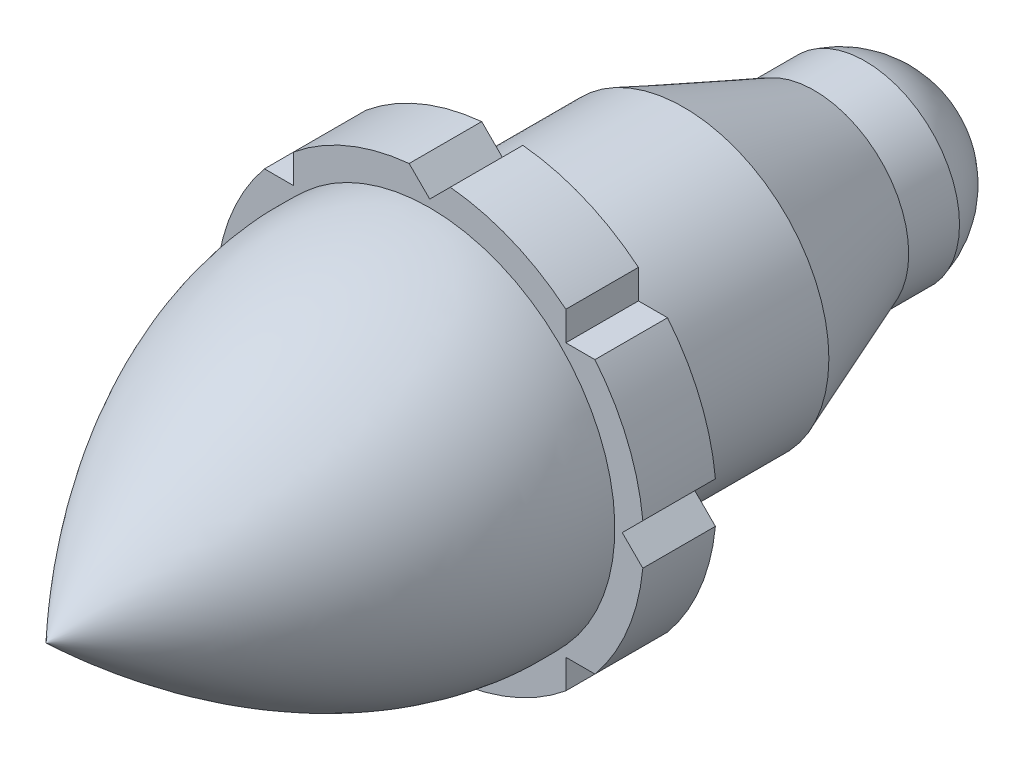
ISO-10303-21;
HEADER;
FILE_DESCRIPTION(('STEP AP214'),'2;1');
FILE_NAME('part.step','',(''),(''),'','','');
FILE_SCHEMA(('AUTOMOTIVE_DESIGN { 1 0 10303 214 1 1 1 1 }'));
ENDSEC;
DATA;
#1=APPLICATION_CONTEXT('core data for automotive mechanical design processes');
#2=APPLICATION_PROTOCOL_DEFINITION('international standard','automotive_design',2000,#1);
#3=PRODUCT_CONTEXT('',#1,'mechanical');
#4=PRODUCT('Part','Part','',(#3));
#5=PRODUCT_RELATED_PRODUCT_CATEGORY('part','',(#4));
#6=PRODUCT_DEFINITION_FORMATION('','',#4);
#7=PRODUCT_DEFINITION_CONTEXT('part definition',#1,'design');
#8=PRODUCT_DEFINITION('design','',#6,#7);
#9=PRODUCT_DEFINITION_SHAPE('','',#8);
#10=(LENGTH_UNIT() NAMED_UNIT(*) SI_UNIT(.MILLI.,.METRE.));
#11=(NAMED_UNIT(*) PLANE_ANGLE_UNIT() SI_UNIT($,.RADIAN.));
#12=(NAMED_UNIT(*) SI_UNIT($,.STERADIAN.) SOLID_ANGLE_UNIT());
#13=UNCERTAINTY_MEASURE_WITH_UNIT(LENGTH_MEASURE(1.E-05),#10,'distance_accuracy_value','');
#14=(GEOMETRIC_REPRESENTATION_CONTEXT(3) GLOBAL_UNCERTAINTY_ASSIGNED_CONTEXT((#13)) GLOBAL_UNIT_ASSIGNED_CONTEXT((#10,
#11,#12)) REPRESENTATION_CONTEXT('',''));
#15=CARTESIAN_POINT('',(0.,0.,0.));
#16=DIRECTION('',(0.,0.,1.));
#17=DIRECTION('',(1.,0.,0.));
#18=AXIS2_PLACEMENT_3D('',#15,#16,#17);
#19=CARTESIAN_POINT('',(0.,0.,5.14883468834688));
#20=DIRECTION('',(0.,0.,1.));
#21=DIRECTION('',(1.,0.,0.));
#22=AXIS2_PLACEMENT_3D('',#19,#20,#21);
#23=CYLINDRICAL_SURFACE('',#22,7.493);
#24=CARTESIAN_POINT('',(0.,0.,0.));
#25=DIRECTION('',(0.,0.,1.));
#26=DIRECTION('',(1.,0.,0.));
#27=AXIS2_PLACEMENT_3D('',#24,#25,#26);
#28=CIRCLE('',#27,7.493);
#29=CARTESIAN_POINT('',(-5.78280630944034,4.76489246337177,0.));
#30=VERTEX_POINT('',#29);
#31=CARTESIAN_POINT('',(-7.45834932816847,0.719773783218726,0.));
#32=VERTEX_POINT('',#31);
#33=EDGE_CURVE('E348',#30,#32,#28,.T.);
#34=ORIENTED_EDGE('',*,*,#33,.T.);
#35=DIRECTION('',(0.,0.,1.));
#36=VECTOR('',#35,1.);
#37=CARTESIAN_POINT('',(-7.45834932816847,0.719773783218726,-15.24));
#38=LINE('',#37,#36);
#39=CARTESIAN_POINT('',(-7.45834932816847,0.719773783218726,2.54));
#40=VERTEX_POINT('',#39);
#41=EDGE_CURVE('E350',#32,#40,#38,.T.);
#42=ORIENTED_EDGE('',*,*,#41,.T.);
#43=CARTESIAN_POINT('',(0.,0.,2.54));
#44=DIRECTION('',(0.,0.,1.));
#45=DIRECTION('',(1.,0.,0.));
#46=AXIS2_PLACEMENT_3D('',#43,#44,#45);
#47=CIRCLE('',#46,7.493);
#48=CARTESIAN_POINT('',(-5.78280630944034,4.76489246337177,2.54));
#49=VERTEX_POINT('',#48);
#50=EDGE_CURVE('E258',#49,#40,#47,.T.);
#51=ORIENTED_EDGE('',*,*,#50,.F.);
#52=DIRECTION('',(0.,0.,1.));
#53=VECTOR('',#52,1.);
#54=CARTESIAN_POINT('',(-5.78280630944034,4.76489246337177,-15.24));
#55=LINE('',#54,#53);
#56=EDGE_CURVE('E351',#30,#49,#55,.T.);
#57=ORIENTED_EDGE('',*,*,#56,.F.);
#58=EDGE_LOOP('',(#34,#42,#51,#57));
#59=FACE_BOUND('',#58,.T.);
#60=ADVANCED_FACE('F49',(#59),#23,.T.);
#61=CARTESIAN_POINT('',(-7.45834932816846,-0.719773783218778,2.54));
#62=VERTEX_POINT('',#61);
#63=CARTESIAN_POINT('',(-5.7828063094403,-4.76489246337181,2.54));
#64=VERTEX_POINT('',#63);
#65=EDGE_CURVE('E813',#62,#64,#47,.T.);
#66=ORIENTED_EDGE('',*,*,#65,.F.);
#67=DIRECTION('',(0.,0.,1.));
#68=VECTOR('',#67,1.);
#69=CARTESIAN_POINT('',(-7.45834932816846,-0.719773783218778,-15.24));
#70=LINE('',#69,#68);
#71=CARTESIAN_POINT('',(-7.45834932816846,-0.719773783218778,0.));
#72=VERTEX_POINT('',#71);
#73=EDGE_CURVE('E481',#72,#62,#70,.T.);
#74=ORIENTED_EDGE('',*,*,#73,.F.);
#75=CARTESIAN_POINT('',(-5.7828063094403,-4.76489246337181,0.));
#76=VERTEX_POINT('',#75);
#77=EDGE_CURVE('E354',#72,#76,#28,.T.);
#78=ORIENTED_EDGE('',*,*,#77,.T.);
#79=DIRECTION('',(0.,0.,1.));
#80=VECTOR('',#79,1.);
#81=CARTESIAN_POINT('',(-5.7828063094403,-4.76489246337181,-15.24));
#82=LINE('',#81,#80);
#83=EDGE_CURVE('E482',#76,#64,#82,.T.);
#84=ORIENTED_EDGE('',*,*,#83,.T.);
#85=EDGE_LOOP('',(#66,#74,#78,#84));
#86=FACE_BOUND('',#85,.T.);
#87=ADVANCED_FACE('F336',(#86),#23,.T.);
#88=CARTESIAN_POINT('',(-4.76489246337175,-5.78280630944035,2.54));
#89=VERTEX_POINT('',#88);
#90=CARTESIAN_POINT('',(-0.719773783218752,-7.45834932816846,2.54));
#91=VERTEX_POINT('',#90);
#92=EDGE_CURVE('E809',#89,#91,#47,.T.);
#93=ORIENTED_EDGE('',*,*,#92,.F.);
#94=DIRECTION('',(0.,0.,1.));
#95=VECTOR('',#94,1.);
#96=CARTESIAN_POINT('',(-4.76489246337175,-5.78280630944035,-15.24));
#97=LINE('',#96,#95);
#98=CARTESIAN_POINT('',(-4.76489246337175,-5.78280630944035,0.));
#99=VERTEX_POINT('',#98);
#100=EDGE_CURVE('E459',#99,#89,#97,.T.);
#101=ORIENTED_EDGE('',*,*,#100,.F.);
#102=CARTESIAN_POINT('',(-0.719773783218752,-7.45834932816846,0.));
#103=VERTEX_POINT('',#102);
#104=EDGE_CURVE('E359',#99,#103,#28,.T.);
#105=ORIENTED_EDGE('',*,*,#104,.T.);
#106=DIRECTION('',(0.,0.,1.));
#107=VECTOR('',#106,1.);
#108=CARTESIAN_POINT('',(-0.719773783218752,-7.45834932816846,-15.24));
#109=LINE('',#108,#107);
#110=EDGE_CURVE('E460',#103,#91,#109,.T.);
#111=ORIENTED_EDGE('',*,*,#110,.T.);
#112=EDGE_LOOP('',(#93,#101,#105,#111));
#113=FACE_BOUND('',#112,.T.);
#114=ADVANCED_FACE('F342',(#113),#23,.T.);
#115=CARTESIAN_POINT('',(0.719773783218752,-7.45834932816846,2.54));
#116=VERTEX_POINT('',#115);
#117=CARTESIAN_POINT('',(4.76489246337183,-5.78280630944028,2.54));
#118=VERTEX_POINT('',#117);
#119=EDGE_CURVE('E251',#116,#118,#47,.T.);
#120=ORIENTED_EDGE('',*,*,#119,.F.);
#121=DIRECTION('',(0.,0.,1.));
#122=VECTOR('',#121,1.);
#123=CARTESIAN_POINT('',(0.719773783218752,-7.45834932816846,-15.24));
#124=LINE('',#123,#122);
#125=CARTESIAN_POINT('',(0.719773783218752,-7.45834932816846,0.));
#126=VERTEX_POINT('',#125);
#127=EDGE_CURVE('E433',#126,#116,#124,.T.);
#128=ORIENTED_EDGE('',*,*,#127,.F.);
#129=CARTESIAN_POINT('',(4.76489246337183,-5.78280630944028,0.));
#130=VERTEX_POINT('',#129);
#131=EDGE_CURVE('E365',#126,#130,#28,.T.);
#132=ORIENTED_EDGE('',*,*,#131,.T.);
#133=DIRECTION('',(0.,0.,1.));
#134=VECTOR('',#133,1.);
#135=CARTESIAN_POINT('',(4.76489246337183,-5.78280630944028,-15.24));
#136=LINE('',#135,#134);
#137=EDGE_CURVE('E434',#130,#118,#136,.T.);
#138=ORIENTED_EDGE('',*,*,#137,.T.);
#139=EDGE_LOOP('',(#120,#128,#132,#138));
#140=FACE_BOUND('',#139,.T.);
#141=ADVANCED_FACE('F665',(#140),#23,.T.);
#142=CARTESIAN_POINT('',(5.78280630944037,-4.76489246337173,2.54));
#143=VERTEX_POINT('',#142);
#144=CARTESIAN_POINT('',(7.45834932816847,-0.719773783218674,2.54));
#145=VERTEX_POINT('',#144);
#146=EDGE_CURVE('E246',#143,#145,#47,.T.);
#147=ORIENTED_EDGE('',*,*,#146,.F.);
#148=DIRECTION('',(0.,0.,1.));
#149=VECTOR('',#148,1.);
#150=CARTESIAN_POINT('',(5.78280630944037,-4.76489246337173,-15.24));
#151=LINE('',#150,#149);
#152=CARTESIAN_POINT('',(5.78280630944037,-4.76489246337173,0.));
#153=VERTEX_POINT('',#152);
#154=EDGE_CURVE('E451',#153,#143,#151,.T.);
#155=ORIENTED_EDGE('',*,*,#154,.F.);
#156=CARTESIAN_POINT('',(7.45834932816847,-0.719773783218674,0.));
#157=VERTEX_POINT('',#156);
#158=EDGE_CURVE('E372',#153,#157,#28,.T.);
#159=ORIENTED_EDGE('',*,*,#158,.T.);
#160=DIRECTION('',(0.,0.,1.));
#161=VECTOR('',#160,1.);
#162=CARTESIAN_POINT('',(7.45834932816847,-0.719773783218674,-15.24));
#163=LINE('',#162,#161);
#164=EDGE_CURVE('E541',#157,#145,#163,.T.);
#165=ORIENTED_EDGE('',*,*,#164,.T.);
#166=EDGE_LOOP('',(#147,#155,#159,#165));
#167=FACE_BOUND('',#166,.T.);
#168=ADVANCED_FACE('F657',(#167),#23,.T.);
#169=CARTESIAN_POINT('',(7.45834932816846,0.71977378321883,2.54));
#170=VERTEX_POINT('',#169);
#171=CARTESIAN_POINT('',(5.78280630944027,4.76489246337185,2.54));
#172=VERTEX_POINT('',#171);
#173=EDGE_CURVE('E236',#170,#172,#47,.T.);
#174=ORIENTED_EDGE('',*,*,#173,.F.);
#175=DIRECTION('',(0.,0.,1.));
#176=VECTOR('',#175,1.);
#177=CARTESIAN_POINT('',(7.45834932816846,0.71977378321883,-15.24));
#178=LINE('',#177,#176);
#179=CARTESIAN_POINT('',(7.45834932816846,0.71977378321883,0.));
#180=VERTEX_POINT('',#179);
#181=EDGE_CURVE('E215',#180,#170,#178,.T.);
#182=ORIENTED_EDGE('',*,*,#181,.F.);
#183=CARTESIAN_POINT('',(5.78280630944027,4.76489246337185,0.));
#184=VERTEX_POINT('',#183);
#185=EDGE_CURVE('E379',#180,#184,#28,.T.);
#186=ORIENTED_EDGE('',*,*,#185,.T.);
#187=DIRECTION('',(0.,0.,1.));
#188=VECTOR('',#187,1.);
#189=CARTESIAN_POINT('',(5.78280630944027,4.76489246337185,-15.24));
#190=LINE('',#189,#188);
#191=EDGE_CURVE('E244',#184,#172,#190,.T.);
#192=ORIENTED_EDGE('',*,*,#191,.T.);
#193=EDGE_LOOP('',(#174,#182,#186,#192));
#194=FACE_BOUND('',#193,.T.);
#195=ADVANCED_FACE('F243',(#194),#23,.T.);
#196=CARTESIAN_POINT('',(-0.719773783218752,7.45834932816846,0.));
#197=VERTEX_POINT('',#196);
#198=CARTESIAN_POINT('',(-4.76489246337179,5.78280630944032,0.));
#199=VERTEX_POINT('',#198);
#200=EDGE_CURVE('E252',#197,#199,#28,.T.);
#201=ORIENTED_EDGE('',*,*,#200,.T.);
#202=DIRECTION('',(0.,0.,1.));
#203=VECTOR('',#202,1.);
#204=CARTESIAN_POINT('',(-4.76489246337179,5.78280630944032,-15.24));
#205=LINE('',#204,#203);
#206=CARTESIAN_POINT('',(-4.76489246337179,5.78280630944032,2.54));
#207=VERTEX_POINT('',#206);
#208=EDGE_CURVE('E409',#199,#207,#205,.T.);
#209=ORIENTED_EDGE('',*,*,#208,.T.);
#210=CARTESIAN_POINT('',(-0.719773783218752,7.45834932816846,2.54));
#211=VERTEX_POINT('',#210);
#212=EDGE_CURVE('E253',#211,#207,#47,.T.);
#213=ORIENTED_EDGE('',*,*,#212,.F.);
#214=DIRECTION('',(0.,0.,1.));
#215=VECTOR('',#214,1.);
#216=CARTESIAN_POINT('',(-0.719773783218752,7.45834932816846,-15.24));
#217=LINE('',#216,#215);
#218=EDGE_CURVE('E280',#197,#211,#217,.T.);
#219=ORIENTED_EDGE('',*,*,#218,.F.);
#220=EDGE_LOOP('',(#201,#209,#213,#219));
#221=FACE_BOUND('',#220,.T.);
#222=ADVANCED_FACE('F284',(#221),#23,.T.);
#223=CARTESIAN_POINT('',(0.,0.,2.54));
#224=DIRECTION('',(0.,0.,-1.));
#225=DIRECTION('',(-1.,0.,0.));
#226=AXIS2_PLACEMENT_3D('',#223,#224,#225);
#227=PLANE('',#226);
#228=CARTESIAN_POINT('',(0.,0.,2.54));
#229=DIRECTION('',(0.,0.,-1.));
#230=DIRECTION('',(-1.,0.,0.));
#231=AXIS2_PLACEMENT_3D('',#228,#229,#230);
#232=CIRCLE('',#231,6.47911724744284);
#233=CARTESIAN_POINT('',(-6.47911724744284,0.,2.54));
#234=VERTEX_POINT('',#233);
#235=EDGE_CURVE('E304',#234,#234,#232,.T.);
#236=ORIENTED_EDGE('',*,*,#235,.T.);
#237=EDGE_LOOP('',(#236));
#238=FACE_BOUND('',#237,.T.);
#239=ORIENTED_EDGE('',*,*,#50,.T.);
#240=DIRECTION('',(-0.707106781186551,0.707106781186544,0.));
#241=VECTOR('',#240,1.);
#242=CARTESIAN_POINT('',(-6.73857554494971,0.,2.54));
#243=LINE('',#242,#241);
#244=CARTESIAN_POINT('',(-6.73857554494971,0.,2.54));
#245=VERTEX_POINT('',#244);
#246=EDGE_CURVE('E504',#245,#40,#243,.T.);
#247=ORIENTED_EDGE('',*,*,#246,.F.);
#248=DIRECTION('',(0.707106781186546,0.707106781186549,0.));
#249=VECTOR('',#248,1.);
#250=CARTESIAN_POINT('',(-6.73857554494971,0.,2.54));
#251=LINE('',#250,#249);
#252=EDGE_CURVE('E513',#62,#245,#251,.T.);
#253=ORIENTED_EDGE('',*,*,#252,.F.);
#254=ORIENTED_EDGE('',*,*,#65,.T.);
#255=DIRECTION('',(-1.,0.,0.));
#256=VECTOR('',#255,1.);
#257=CARTESIAN_POINT('',(-4.76489246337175,-4.7648924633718,2.54));
#258=LINE('',#257,#256);
#259=CARTESIAN_POINT('',(-4.76489246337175,-4.7648924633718,2.54));
#260=VERTEX_POINT('',#259);
#261=EDGE_CURVE('E485',#260,#64,#258,.T.);
#262=ORIENTED_EDGE('',*,*,#261,.F.);
#263=DIRECTION('',(0.,1.,0.));
#264=VECTOR('',#263,1.);
#265=CARTESIAN_POINT('',(-4.76489246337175,-4.7648924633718,2.54));
#266=LINE('',#265,#264);
#267=EDGE_CURVE('E495',#89,#260,#266,.T.);
#268=ORIENTED_EDGE('',*,*,#267,.F.);
#269=ORIENTED_EDGE('',*,*,#92,.T.);
#270=DIRECTION('',(-0.707106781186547,-0.707106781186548,0.));
#271=VECTOR('',#270,1.);
#272=CARTESIAN_POINT('',(0.,-6.73857554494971,2.54));
#273=LINE('',#272,#271);
#274=CARTESIAN_POINT('',(0.,-6.73857554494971,2.54));
#275=VERTEX_POINT('',#274);
#276=EDGE_CURVE('E463',#275,#91,#273,.T.);
#277=ORIENTED_EDGE('',*,*,#276,.F.);
#278=DIRECTION('',(-0.707106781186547,0.707106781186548,0.));
#279=VECTOR('',#278,1.);
#280=CARTESIAN_POINT('',(0.,-6.73857554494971,2.54));
#281=LINE('',#280,#279);
#282=EDGE_CURVE('E474',#116,#275,#281,.T.);
#283=ORIENTED_EDGE('',*,*,#282,.F.);
#284=ORIENTED_EDGE('',*,*,#119,.T.);
#285=DIRECTION('',(0.,-1.,0.));
#286=VECTOR('',#285,1.);
#287=CARTESIAN_POINT('',(4.76489246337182,-4.76489246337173,2.54));
#288=LINE('',#287,#286);
#289=CARTESIAN_POINT('',(4.76489246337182,-4.76489246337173,2.54));
#290=VERTEX_POINT('',#289);
#291=EDGE_CURVE('E437',#290,#118,#288,.T.);
#292=ORIENTED_EDGE('',*,*,#291,.F.);
#293=DIRECTION('',(-1.,0.,0.));
#294=VECTOR('',#293,1.);
#295=CARTESIAN_POINT('',(4.76489246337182,-4.76489246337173,2.54));
#296=LINE('',#295,#294);
#297=EDGE_CURVE('E448',#143,#290,#296,.T.);
#298=ORIENTED_EDGE('',*,*,#297,.F.);
#299=ORIENTED_EDGE('',*,*,#146,.T.);
#300=DIRECTION('',(0.707106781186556,-0.707106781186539,0.));
#301=VECTOR('',#300,1.);
#302=CARTESIAN_POINT('',(6.73857554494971,0.,2.54));
#303=LINE('',#302,#301);
#304=CARTESIAN_POINT('',(6.73857554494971,0.,2.54));
#305=VERTEX_POINT('',#304);
#306=EDGE_CURVE('E238',#305,#145,#303,.T.);
#307=ORIENTED_EDGE('',*,*,#306,.F.);
#308=DIRECTION('',(-0.707106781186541,-0.707106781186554,0.));
#309=VECTOR('',#308,1.);
#310=CARTESIAN_POINT('',(6.73857554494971,0.,2.54));
#311=LINE('',#310,#309);
#312=EDGE_CURVE('E219',#170,#305,#311,.T.);
#313=ORIENTED_EDGE('',*,*,#312,.F.);
#314=ORIENTED_EDGE('',*,*,#173,.T.);
#315=DIRECTION('',(1.,0.,0.));
#316=VECTOR('',#315,1.);
#317=CARTESIAN_POINT('',(4.76489246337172,4.76489246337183,2.54));
#318=LINE('',#317,#316);
#319=CARTESIAN_POINT('',(4.76489246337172,4.76489246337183,2.54));
#320=VERTEX_POINT('',#319);
#321=EDGE_CURVE('E523',#320,#172,#318,.T.);
#322=ORIENTED_EDGE('',*,*,#321,.F.);
#323=DIRECTION('',(0.,-1.,0.));
#324=VECTOR('',#323,1.);
#325=CARTESIAN_POINT('',(4.76489246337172,4.76489246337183,2.54));
#326=LINE('',#325,#324);
#327=CARTESIAN_POINT('',(4.76489246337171,5.78280630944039,2.54));
#328=VERTEX_POINT('',#327);
#329=EDGE_CURVE('E533',#328,#320,#326,.T.);
#330=ORIENTED_EDGE('',*,*,#329,.F.);
#331=CARTESIAN_POINT('',(0.719773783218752,7.45834932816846,2.54));
#332=VERTEX_POINT('',#331);
#333=EDGE_CURVE('E247',#328,#332,#47,.T.);
#334=ORIENTED_EDGE('',*,*,#333,.T.);
#335=DIRECTION('',(0.707106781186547,0.707106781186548,0.));
#336=VECTOR('',#335,1.);
#337=CARTESIAN_POINT('',(0.,6.73857554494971,2.54));
#338=LINE('',#337,#336);
#339=CARTESIAN_POINT('',(0.,6.73857554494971,2.54));
#340=VERTEX_POINT('',#339);
#341=EDGE_CURVE('E403',#340,#332,#338,.T.);
#342=ORIENTED_EDGE('',*,*,#341,.F.);
#343=DIRECTION('',(0.707106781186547,-0.707106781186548,0.));
#344=VECTOR('',#343,1.);
#345=CARTESIAN_POINT('',(0.,6.73857554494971,2.54));
#346=LINE('',#345,#344);
#347=EDGE_CURVE('E293',#211,#340,#346,.T.);
#348=ORIENTED_EDGE('',*,*,#347,.F.);
#349=ORIENTED_EDGE('',*,*,#212,.T.);
#350=DIRECTION('',(0.,1.,0.));
#351=VECTOR('',#350,1.);
#352=CARTESIAN_POINT('',(-4.76489246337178,4.76489246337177,2.54));
#353=LINE('',#352,#351);
#354=CARTESIAN_POINT('',(-4.76489246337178,4.76489246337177,2.54));
#355=VERTEX_POINT('',#354);
#356=EDGE_CURVE('E414',#355,#207,#353,.T.);
#357=ORIENTED_EDGE('',*,*,#356,.F.);
#358=DIRECTION('',(1.,0.,0.));
#359=VECTOR('',#358,1.);
#360=CARTESIAN_POINT('',(-4.76489246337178,4.76489246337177,2.54));
#361=LINE('',#360,#359);
#362=EDGE_CURVE('E424',#49,#355,#361,.T.);
#363=ORIENTED_EDGE('',*,*,#362,.F.);
#364=EDGE_LOOP('',(#239,#247,#253,#254,#262,#268,#269,#277,#283,#284,#292,#298,#299,#307,#313,
#314,#322,#330,#334,#342,#348,#349,#357,#363));
#365=FACE_BOUND('',#364,.T.);
#366=ADVANCED_FACE('F234',(#238,#365),#227,.F.);
#367=ORIENTED_EDGE('',*,*,#333,.F.);
#368=DIRECTION('',(0.,0.,1.));
#369=VECTOR('',#368,1.);
#370=CARTESIAN_POINT('',(4.76489246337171,5.78280630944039,-15.24));
#371=LINE('',#370,#369);
#372=CARTESIAN_POINT('',(4.76489246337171,5.78280630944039,0.));
#373=VERTEX_POINT('',#372);
#374=EDGE_CURVE('E397',#373,#328,#371,.T.);
#375=ORIENTED_EDGE('',*,*,#374,.F.);
#376=CARTESIAN_POINT('',(0.719773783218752,7.45834932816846,0.));
#377=VERTEX_POINT('',#376);
#378=EDGE_CURVE('E357',#373,#377,#28,.T.);
#379=ORIENTED_EDGE('',*,*,#378,.T.);
#380=DIRECTION('',(0.,0.,1.));
#381=VECTOR('',#380,1.);
#382=CARTESIAN_POINT('',(0.719773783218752,7.45834932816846,-15.24));
#383=LINE('',#382,#381);
#384=EDGE_CURVE('E287',#377,#332,#383,.T.);
#385=ORIENTED_EDGE('',*,*,#384,.T.);
#386=EDGE_LOOP('',(#367,#375,#379,#385));
#387=FACE_BOUND('',#386,.T.);
#388=ADVANCED_FACE('F326',(#387),#23,.T.);
#389=CARTESIAN_POINT('',(0.,7.493,0.));
#390=DIRECTION('',(0.,0.,1.));
#391=DIRECTION('',(1.,0.,0.));
#392=AXIS2_PLACEMENT_3D('',#389,#390,#391);
#393=PLANE('',#392);
#394=DIRECTION('',(0.707106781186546,0.707106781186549,0.));
#395=VECTOR('',#394,1.);
#396=CARTESIAN_POINT('',(-7.11578777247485,-0.377212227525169,0.));
#397=LINE('',#396,#395);
#398=CARTESIAN_POINT('',(-6.73857554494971,0.,0.));
#399=VERTEX_POINT('',#398);
#400=EDGE_CURVE('E507',#72,#399,#397,.T.);
#401=ORIENTED_EDGE('',*,*,#400,.T.);
#402=DIRECTION('',(-0.707106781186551,0.707106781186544,0.));
#403=VECTOR('',#402,1.);
#404=CARTESIAN_POINT('',(-7.11578777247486,0.37721222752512,0.));
#405=LINE('',#404,#403);
#406=EDGE_CURVE('E65',#399,#32,#405,.T.);
#407=ORIENTED_EDGE('',*,*,#406,.T.);
#408=ORIENTED_EDGE('',*,*,#33,.F.);
#409=DIRECTION('',(1.,0.,0.));
#410=VECTOR('',#409,1.);
#411=CARTESIAN_POINT('',(-5.29835111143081,4.76489246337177,0.));
#412=LINE('',#411,#410);
#413=CARTESIAN_POINT('',(-4.76489246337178,4.76489246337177,0.));
#414=VERTEX_POINT('',#413);
#415=EDGE_CURVE('E417',#30,#414,#412,.T.);
#416=ORIENTED_EDGE('',*,*,#415,.T.);
#417=DIRECTION('',(0.,1.,0.));
#418=VECTOR('',#417,1.);
#419=CARTESIAN_POINT('',(-4.76489246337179,5.29835111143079,0.));
#420=LINE('',#419,#418);
#421=EDGE_CURVE('E405',#414,#199,#420,.T.);
#422=ORIENTED_EDGE('',*,*,#421,.T.);
#423=ORIENTED_EDGE('',*,*,#200,.F.);
#424=DIRECTION('',(0.707106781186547,-0.707106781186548,0.));
#425=VECTOR('',#424,1.);
#426=CARTESIAN_POINT('',(-0.377212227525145,7.11578777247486,0.));
#427=LINE('',#426,#425);
#428=CARTESIAN_POINT('',(0.,6.73857554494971,0.));
#429=VERTEX_POINT('',#428);
#430=EDGE_CURVE('E58',#197,#429,#427,.T.);
#431=ORIENTED_EDGE('',*,*,#430,.T.);
#432=DIRECTION('',(0.707106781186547,0.707106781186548,0.));
#433=VECTOR('',#432,1.);
#434=CARTESIAN_POINT('',(0.377212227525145,7.11578777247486,0.));
#435=LINE('',#434,#433);
#436=EDGE_CURVE('E11',#429,#377,#435,.T.);
#437=ORIENTED_EDGE('',*,*,#436,.T.);
#438=ORIENTED_EDGE('',*,*,#378,.F.);
#439=DIRECTION('',(0.,-1.,0.));
#440=VECTOR('',#439,1.);
#441=CARTESIAN_POINT('',(4.76489246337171,5.29835111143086,0.));
#442=LINE('',#441,#440);
#443=CARTESIAN_POINT('',(4.76489246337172,4.76489246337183,0.));
#444=VERTEX_POINT('',#443);
#445=EDGE_CURVE('E526',#373,#444,#442,.T.);
#446=ORIENTED_EDGE('',*,*,#445,.T.);
#447=DIRECTION('',(1.,0.,0.));
#448=VECTOR('',#447,1.);
#449=CARTESIAN_POINT('',(5.29835111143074,4.76489246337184,0.));
#450=LINE('',#449,#448);
#451=EDGE_CURVE('E228',#444,#184,#450,.T.);
#452=ORIENTED_EDGE('',*,*,#451,.T.);
#453=ORIENTED_EDGE('',*,*,#185,.F.);
#454=DIRECTION('',(-0.707106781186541,-0.707106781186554,0.));
#455=VECTOR('',#454,1.);
#456=CARTESIAN_POINT('',(7.11578777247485,0.377212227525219,0.));
#457=LINE('',#456,#455);
#458=CARTESIAN_POINT('',(6.73857554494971,0.,0.));
#459=VERTEX_POINT('',#458);
#460=EDGE_CURVE('E222',#180,#459,#457,.T.);
#461=ORIENTED_EDGE('',*,*,#460,.T.);
#462=DIRECTION('',(0.707106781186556,-0.707106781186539,0.));
#463=VECTOR('',#462,1.);
#464=CARTESIAN_POINT('',(7.11578777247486,-0.37721222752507,0.));
#465=LINE('',#464,#463);
#466=EDGE_CURVE('E454',#459,#157,#465,.T.);
#467=ORIENTED_EDGE('',*,*,#466,.T.);
#468=ORIENTED_EDGE('',*,*,#158,.F.);
#469=DIRECTION('',(-1.,0.,0.));
#470=VECTOR('',#469,1.);
#471=CARTESIAN_POINT('',(5.29835111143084,-4.76489246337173,0.));
#472=LINE('',#471,#470);
#473=CARTESIAN_POINT('',(4.76489246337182,-4.76489246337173,0.));
#474=VERTEX_POINT('',#473);
#475=EDGE_CURVE('E440',#153,#474,#472,.T.);
#476=ORIENTED_EDGE('',*,*,#475,.T.);
#477=DIRECTION('',(0.,-1.,0.));
#478=VECTOR('',#477,1.);
#479=CARTESIAN_POINT('',(4.76489246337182,-5.29835111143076,0.));
#480=LINE('',#479,#478);
#481=EDGE_CURVE('E429',#474,#130,#480,.T.);
#482=ORIENTED_EDGE('',*,*,#481,.T.);
#483=ORIENTED_EDGE('',*,*,#131,.F.);
#484=DIRECTION('',(-0.707106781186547,0.707106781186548,0.));
#485=VECTOR('',#484,1.);
#486=CARTESIAN_POINT('',(0.377212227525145,-7.11578777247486,0.));
#487=LINE('',#486,#485);
#488=CARTESIAN_POINT('',(0.,-6.73857554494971,0.));
#489=VERTEX_POINT('',#488);
#490=EDGE_CURVE('E466',#126,#489,#487,.T.);
#491=ORIENTED_EDGE('',*,*,#490,.T.);
#492=DIRECTION('',(-0.707106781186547,-0.707106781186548,0.));
#493=VECTOR('',#492,1.);
#494=CARTESIAN_POINT('',(-0.377212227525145,-7.11578777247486,0.));
#495=LINE('',#494,#493);
#496=EDGE_CURVE('E455',#489,#103,#495,.T.);
#497=ORIENTED_EDGE('',*,*,#496,.T.);
#498=ORIENTED_EDGE('',*,*,#104,.F.);
#499=DIRECTION('',(0.,1.,0.));
#500=VECTOR('',#499,1.);
#501=CARTESIAN_POINT('',(-4.76489246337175,-5.29835111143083,0.));
#502=LINE('',#501,#500);
#503=CARTESIAN_POINT('',(-4.76489246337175,-4.7648924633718,0.));
#504=VERTEX_POINT('',#503);
#505=EDGE_CURVE('E488',#99,#504,#502,.T.);
#506=ORIENTED_EDGE('',*,*,#505,.T.);
#507=DIRECTION('',(-1.,0.,0.));
#508=VECTOR('',#507,1.);
#509=CARTESIAN_POINT('',(-5.29835111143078,-4.7648924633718,0.));
#510=LINE('',#509,#508);
#511=EDGE_CURVE('E73',#504,#76,#510,.T.);
#512=ORIENTED_EDGE('',*,*,#511,.T.);
#513=ORIENTED_EDGE('',*,*,#77,.F.);
#514=EDGE_LOOP('',(#401,#407,#408,#416,#422,#423,#431,#437,#438,#446,#452,#453,#461,#467,#468,
#476,#482,#483,#491,#497,#498,#506,#512,#513));
#515=FACE_BOUND('',#514,.T.);
#516=CARTESIAN_POINT('',(0.,0.,0.));
#517=DIRECTION('',(0.,0.,1.));
#518=DIRECTION('',(1.,0.,0.));
#519=AXIS2_PLACEMENT_3D('',#516,#517,#518);
#520=CIRCLE('',#519,5.08);
#521=CARTESIAN_POINT('',(5.08,0.,0.));
#522=VERTEX_POINT('',#521);
#523=EDGE_CURVE('E386',#522,#522,#520,.T.);
#524=ORIENTED_EDGE('',*,*,#523,.T.);
#525=EDGE_LOOP('',(#524));
#526=FACE_BOUND('',#525,.T.);
#527=ADVANCED_FACE('F270',(#515,#526),#393,.F.);
#528=CARTESIAN_POINT('',(0.,0.,5.14883468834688));
#529=DIRECTION('',(0.,0.,1.));
#530=DIRECTION('',(1.,0.,0.));
#531=AXIS2_PLACEMENT_3D('',#528,#529,#530);
#532=CYLINDRICAL_SURFACE('',#531,5.08);
#533=CARTESIAN_POINT('',(0.,0.,-6.35));
#534=DIRECTION('',(0.,0.,1.));
#535=DIRECTION('',(1.,0.,0.));
#536=AXIS2_PLACEMENT_3D('',#533,#534,#535);
#537=CIRCLE('',#536,5.08);
#538=CARTESIAN_POINT('',(5.08,0.,-6.35));
#539=VERTEX_POINT('',#538);
#540=EDGE_CURVE('E263',#539,#539,#537,.T.);
#541=ORIENTED_EDGE('',*,*,#540,.T.);
#542=EDGE_LOOP('',(#541));
#543=FACE_BOUND('',#542,.T.);
#544=ORIENTED_EDGE('',*,*,#523,.F.);
#545=EDGE_LOOP('',(#544));
#546=FACE_BOUND('',#545,.T.);
#547=ADVANCED_FACE('F318',(#543,#546),#532,.T.);
#548=CARTESIAN_POINT('',(0.,6.47911724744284,2.54));
#549=CARTESIAN_POINT('',(0.,6.78507922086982,7.63876105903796));
#550=CARTESIAN_POINT('',(0.,3.22681498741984,12.5530213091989));
#551=CARTESIAN_POINT('',(0.,0.,15.968673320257));
#552=B_SPLINE_CURVE_WITH_KNOTS('',3,(#548,#549,#550,#551),.UNSPECIFIED.,.F.,.F.,(4,4),(0.,1.),.UNSPECIFIED.);
#553=CARTESIAN_POINT('',(0.,0.,0.));
#554=DIRECTION('',(0.,0.,-1.));
#555=AXIS1_PLACEMENT('',#553,#554);
#556=SURFACE_OF_REVOLUTION('',#552,#555);
#557=CARTESIAN_POINT('',(0.,0.,15.968673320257));
#558=VERTEX_POINT('',#557);
#559=VERTEX_LOOP('',#558);
#560=FACE_BOUND('',#559,.T.);
#561=ORIENTED_EDGE('',*,*,#235,.F.);
#562=EDGE_LOOP('',(#561));
#563=FACE_BOUND('',#562,.T.);
#564=ADVANCED_FACE('F313',(#560,#563),#556,.F.);
#565=CARTESIAN_POINT('',(0.,0.,25.5352078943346));
#566=DIRECTION('',(0.,0.,1.));
#567=DIRECTION('',(1.,0.,0.));
#568=AXIS2_PLACEMENT_3D('',#565,#566,#567);
#569=CYLINDRICAL_SURFACE('',#568,3.302);
#570=CARTESIAN_POINT('',(0.,0.,-12.7));
#571=DIRECTION('',(0.,0.,1.));
#572=DIRECTION('',(1.,0.,0.));
#573=AXIS2_PLACEMENT_3D('',#570,#571,#572);
#574=CIRCLE('',#573,3.302);
#575=CARTESIAN_POINT('',(3.302,0.,-12.7));
#576=VERTEX_POINT('',#575);
#577=EDGE_CURVE('E260',#576,#576,#574,.T.);
#578=ORIENTED_EDGE('',*,*,#577,.T.);
#579=EDGE_LOOP('',(#578));
#580=FACE_BOUND('',#579,.T.);
#581=CARTESIAN_POINT('',(0.,0.,-10.922));
#582=DIRECTION('',(0.,0.,1.));
#583=DIRECTION('',(1.,0.,0.));
#584=AXIS2_PLACEMENT_3D('',#581,#582,#583);
#585=CIRCLE('',#584,3.302);
#586=CARTESIAN_POINT('',(3.302,0.,-10.922));
#587=VERTEX_POINT('',#586);
#588=EDGE_CURVE('E300',#587,#587,#585,.T.);
#589=ORIENTED_EDGE('',*,*,#588,.F.);
#590=EDGE_LOOP('',(#589));
#591=FACE_BOUND('',#590,.T.);
#592=ADVANCED_FACE('F317',(#580,#591),#569,.T.);
#593=CARTESIAN_POINT('',(0.,0.,-6.35));
#594=DIRECTION('',(0.,0.,1.));
#595=DIRECTION('',(1.,0.,0.));
#596=AXIS2_PLACEMENT_3D('',#593,#594,#595);
#597=CONICAL_SURFACE('',#596,5.08,0.370891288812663);
#598=ORIENTED_EDGE('',*,*,#588,.T.);
#599=EDGE_LOOP('',(#598));
#600=FACE_BOUND('',#599,.T.);
#601=ORIENTED_EDGE('',*,*,#540,.F.);
#602=EDGE_LOOP('',(#601));
#603=FACE_BOUND('',#602,.T.);
#604=ADVANCED_FACE('F607',(#600,#603),#597,.T.);
#605=CARTESIAN_POINT('',(0.,0.,-11.8237));
#606=DIRECTION('',(0.,0.,1.));
#607=DIRECTION('',(1.,0.,0.));
#608=AXIS2_PLACEMENT_3D('',#605,#606,#607);
#609=SPHERICAL_SURFACE('',#608,3.4163);
#610=ORIENTED_EDGE('',*,*,#577,.F.);
#611=EDGE_LOOP('',(#610));
#612=FACE_BOUND('',#611,.T.);
#613=ADVANCED_FACE('F51',(#612),#609,.T.);
#614=CARTESIAN_POINT('',(0.,6.73857554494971,-15.24));
#615=DIRECTION('',(0.707106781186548,-0.707106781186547,0.));
#616=DIRECTION('',(0.707106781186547,0.707106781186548,0.));
#617=AXIS2_PLACEMENT_3D('',#614,#615,#616);
#618=PLANE('',#617);
#619=DIRECTION('',(0.,0.,1.));
#620=VECTOR('',#619,1.);
#621=CARTESIAN_POINT('',(0.,6.73857554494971,-15.24));
#622=LINE('',#621,#620);
#623=EDGE_CURVE('E264',#429,#340,#622,.T.);
#624=ORIENTED_EDGE('',*,*,#623,.T.);
#625=ORIENTED_EDGE('',*,*,#341,.T.);
#626=ORIENTED_EDGE('',*,*,#384,.F.);
#627=ORIENTED_EDGE('',*,*,#436,.F.);
#628=EDGE_LOOP('',(#624,#625,#626,#627));
#629=FACE_BOUND('',#628,.T.);
#630=ADVANCED_FACE('F401',(#629),#618,.F.);
#631=CARTESIAN_POINT('',(0.,6.73857554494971,-15.24));
#632=DIRECTION('',(-0.707106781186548,-0.707106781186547,0.));
#633=DIRECTION('',(0.707106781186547,-0.707106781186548,0.));
#634=AXIS2_PLACEMENT_3D('',#631,#632,#633);
#635=PLANE('',#634);
#636=ORIENTED_EDGE('',*,*,#218,.T.);
#637=ORIENTED_EDGE('',*,*,#347,.T.);
#638=ORIENTED_EDGE('',*,*,#623,.F.);
#639=ORIENTED_EDGE('',*,*,#430,.F.);
#640=EDGE_LOOP('',(#636,#637,#638,#639));
#641=FACE_BOUND('',#640,.T.);
#642=ADVANCED_FACE('F278',(#641),#635,.F.);
#643=CARTESIAN_POINT('',(-4.76489246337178,4.76489246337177,-15.24));
#644=DIRECTION('',(1.,0.,0.));
#645=DIRECTION('',(0.,1.,0.));
#646=AXIS2_PLACEMENT_3D('',#643,#644,#645);
#647=PLANE('',#646);
#648=DIRECTION('',(0.,0.,1.));
#649=VECTOR('',#648,1.);
#650=CARTESIAN_POINT('',(-4.76489246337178,4.76489246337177,-15.24));
#651=LINE('',#650,#649);
#652=EDGE_CURVE('E420',#414,#355,#651,.T.);
#653=ORIENTED_EDGE('',*,*,#652,.T.);
#654=ORIENTED_EDGE('',*,*,#356,.T.);
#655=ORIENTED_EDGE('',*,*,#208,.F.);
#656=ORIENTED_EDGE('',*,*,#421,.F.);
#657=EDGE_LOOP('',(#653,#654,#655,#656));
#658=FACE_BOUND('',#657,.T.);
#659=ADVANCED_FACE('F600',(#658),#647,.F.);
#660=CARTESIAN_POINT('',(-4.76489246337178,4.76489246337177,-15.24));
#661=DIRECTION('',(0.,-1.,0.));
#662=DIRECTION('',(1.,0.,0.));
#663=AXIS2_PLACEMENT_3D('',#660,#661,#662);
#664=PLANE('',#663);
#665=ORIENTED_EDGE('',*,*,#56,.T.);
#666=ORIENTED_EDGE('',*,*,#362,.T.);
#667=ORIENTED_EDGE('',*,*,#652,.F.);
#668=ORIENTED_EDGE('',*,*,#415,.F.);
#669=EDGE_LOOP('',(#665,#666,#667,#668));
#670=FACE_BOUND('',#669,.T.);
#671=ADVANCED_FACE('F564',(#670),#664,.F.);
#672=CARTESIAN_POINT('',(4.76489246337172,4.76489246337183,-15.24));
#673=DIRECTION('',(0.,-1.,0.));
#674=DIRECTION('',(1.,0.,0.));
#675=AXIS2_PLACEMENT_3D('',#672,#673,#674);
#676=PLANE('',#675);
#677=DIRECTION('',(0.,0.,1.));
#678=VECTOR('',#677,1.);
#679=CARTESIAN_POINT('',(4.76489246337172,4.76489246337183,-15.24));
#680=LINE('',#679,#678);
#681=EDGE_CURVE('E529',#444,#320,#680,.T.);
#682=ORIENTED_EDGE('',*,*,#681,.T.);
#683=ORIENTED_EDGE('',*,*,#321,.T.);
#684=ORIENTED_EDGE('',*,*,#191,.F.);
#685=ORIENTED_EDGE('',*,*,#451,.F.);
#686=EDGE_LOOP('',(#682,#683,#684,#685));
#687=FACE_BOUND('',#686,.T.);
#688=ADVANCED_FACE('F553',(#687),#676,.F.);
#689=CARTESIAN_POINT('',(4.76489246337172,4.76489246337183,-15.24));
#690=DIRECTION('',(-1.,0.,0.));
#691=DIRECTION('',(0.,-1.,0.));
#692=AXIS2_PLACEMENT_3D('',#689,#690,#691);
#693=PLANE('',#692);
#694=ORIENTED_EDGE('',*,*,#374,.T.);
#695=ORIENTED_EDGE('',*,*,#329,.T.);
#696=ORIENTED_EDGE('',*,*,#681,.F.);
#697=ORIENTED_EDGE('',*,*,#445,.F.);
#698=EDGE_LOOP('',(#694,#695,#696,#697));
#699=FACE_BOUND('',#698,.T.);
#700=ADVANCED_FACE('F555',(#699),#693,.F.);
#701=CARTESIAN_POINT('',(6.73857554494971,0.,-15.24));
#702=DIRECTION('',(-0.707106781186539,-0.707106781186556,0.));
#703=DIRECTION('',(0.707106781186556,-0.707106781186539,0.));
#704=AXIS2_PLACEMENT_3D('',#701,#702,#703);
#705=PLANE('',#704);
#706=DIRECTION('',(0.,0.,1.));
#707=VECTOR('',#706,1.);
#708=CARTESIAN_POINT('',(6.73857554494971,0.,-15.24));
#709=LINE('',#708,#707);
#710=EDGE_CURVE('E240',#459,#305,#709,.T.);
#711=ORIENTED_EDGE('',*,*,#710,.T.);
#712=ORIENTED_EDGE('',*,*,#306,.T.);
#713=ORIENTED_EDGE('',*,*,#164,.F.);
#714=ORIENTED_EDGE('',*,*,#466,.F.);
#715=EDGE_LOOP('',(#711,#712,#713,#714));
#716=FACE_BOUND('',#715,.T.);
#717=ADVANCED_FACE('F550',(#716),#705,.F.);
#718=CARTESIAN_POINT('',(6.73857554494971,0.,-15.24));
#719=DIRECTION('',(-0.707106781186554,0.707106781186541,0.));
#720=DIRECTION('',(-0.707106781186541,-0.707106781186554,0.));
#721=AXIS2_PLACEMENT_3D('',#718,#719,#720);
#722=PLANE('',#721);
#723=ORIENTED_EDGE('',*,*,#181,.T.);
#724=ORIENTED_EDGE('',*,*,#312,.T.);
#725=ORIENTED_EDGE('',*,*,#710,.F.);
#726=ORIENTED_EDGE('',*,*,#460,.F.);
#727=EDGE_LOOP('',(#723,#724,#725,#726));
#728=FACE_BOUND('',#727,.T.);
#729=ADVANCED_FACE('F217',(#728),#722,.F.);
#730=CARTESIAN_POINT('',(4.76489246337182,-4.76489246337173,-15.24));
#731=DIRECTION('',(-1.,0.,0.));
#732=DIRECTION('',(0.,-1.,0.));
#733=AXIS2_PLACEMENT_3D('',#730,#731,#732);
#734=PLANE('',#733);
#735=DIRECTION('',(0.,0.,1.));
#736=VECTOR('',#735,1.);
#737=CARTESIAN_POINT('',(4.76489246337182,-4.76489246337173,-15.24));
#738=LINE('',#737,#736);
#739=EDGE_CURVE('E444',#474,#290,#738,.T.);
#740=ORIENTED_EDGE('',*,*,#739,.T.);
#741=ORIENTED_EDGE('',*,*,#291,.T.);
#742=ORIENTED_EDGE('',*,*,#137,.F.);
#743=ORIENTED_EDGE('',*,*,#481,.F.);
#744=EDGE_LOOP('',(#740,#741,#742,#743));
#745=FACE_BOUND('',#744,.T.);
#746=ADVANCED_FACE('F593',(#745),#734,.F.);
#747=CARTESIAN_POINT('',(4.76489246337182,-4.76489246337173,-15.24));
#748=DIRECTION('',(0.,1.,0.));
#749=DIRECTION('',(-1.,0.,0.));
#750=AXIS2_PLACEMENT_3D('',#747,#748,#749);
#751=PLANE('',#750);
#752=ORIENTED_EDGE('',*,*,#154,.T.);
#753=ORIENTED_EDGE('',*,*,#297,.T.);
#754=ORIENTED_EDGE('',*,*,#739,.F.);
#755=ORIENTED_EDGE('',*,*,#475,.F.);
#756=EDGE_LOOP('',(#752,#753,#754,#755));
#757=FACE_BOUND('',#756,.T.);
#758=ADVANCED_FACE('F589',(#757),#751,.F.);
#759=CARTESIAN_POINT('',(0.,-6.73857554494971,-15.24));
#760=DIRECTION('',(-0.707106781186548,0.707106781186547,0.));
#761=DIRECTION('',(-0.707106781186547,-0.707106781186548,0.));
#762=AXIS2_PLACEMENT_3D('',#759,#760,#761);
#763=PLANE('',#762);
#764=DIRECTION('',(0.,0.,1.));
#765=VECTOR('',#764,1.);
#766=CARTESIAN_POINT('',(0.,-6.73857554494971,-15.24));
#767=LINE('',#766,#765);
#768=EDGE_CURVE('E470',#489,#275,#767,.T.);
#769=ORIENTED_EDGE('',*,*,#768,.T.);
#770=ORIENTED_EDGE('',*,*,#276,.T.);
#771=ORIENTED_EDGE('',*,*,#110,.F.);
#772=ORIENTED_EDGE('',*,*,#496,.F.);
#773=EDGE_LOOP('',(#769,#770,#771,#772));
#774=FACE_BOUND('',#773,.T.);
#775=ADVANCED_FACE('F585',(#774),#763,.F.);
#776=CARTESIAN_POINT('',(0.,-6.73857554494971,-15.24));
#777=DIRECTION('',(0.707106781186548,0.707106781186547,0.));
#778=DIRECTION('',(-0.707106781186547,0.707106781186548,0.));
#779=AXIS2_PLACEMENT_3D('',#776,#777,#778);
#780=PLANE('',#779);
#781=ORIENTED_EDGE('',*,*,#127,.T.);
#782=ORIENTED_EDGE('',*,*,#282,.T.);
#783=ORIENTED_EDGE('',*,*,#768,.F.);
#784=ORIENTED_EDGE('',*,*,#490,.F.);
#785=EDGE_LOOP('',(#781,#782,#783,#784));
#786=FACE_BOUND('',#785,.T.);
#787=ADVANCED_FACE('F582',(#786),#780,.F.);
#788=CARTESIAN_POINT('',(-4.76489246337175,-4.7648924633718,-15.24));
#789=DIRECTION('',(0.,1.,0.));
#790=DIRECTION('',(-1.,0.,0.));
#791=AXIS2_PLACEMENT_3D('',#788,#789,#790);
#792=PLANE('',#791);
#793=DIRECTION('',(0.,0.,1.));
#794=VECTOR('',#793,1.);
#795=CARTESIAN_POINT('',(-4.76489246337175,-4.7648924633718,-15.24));
#796=LINE('',#795,#794);
#797=EDGE_CURVE('E492',#504,#260,#796,.T.);
#798=ORIENTED_EDGE('',*,*,#797,.T.);
#799=ORIENTED_EDGE('',*,*,#261,.T.);
#800=ORIENTED_EDGE('',*,*,#83,.F.);
#801=ORIENTED_EDGE('',*,*,#511,.F.);
#802=EDGE_LOOP('',(#798,#799,#800,#801));
#803=FACE_BOUND('',#802,.T.);
#804=ADVANCED_FACE('F578',(#803),#792,.F.);
#805=CARTESIAN_POINT('',(-4.76489246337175,-4.7648924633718,-15.24));
#806=DIRECTION('',(1.,0.,0.));
#807=DIRECTION('',(0.,1.,0.));
#808=AXIS2_PLACEMENT_3D('',#805,#806,#807);
#809=PLANE('',#808);
#810=ORIENTED_EDGE('',*,*,#100,.T.);
#811=ORIENTED_EDGE('',*,*,#267,.T.);
#812=ORIENTED_EDGE('',*,*,#797,.F.);
#813=ORIENTED_EDGE('',*,*,#505,.F.);
#814=EDGE_LOOP('',(#810,#811,#812,#813));
#815=FACE_BOUND('',#814,.T.);
#816=ADVANCED_FACE('F575',(#815),#809,.F.);
#817=CARTESIAN_POINT('',(-6.73857554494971,0.,-15.24));
#818=DIRECTION('',(0.707106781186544,0.707106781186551,0.));
#819=DIRECTION('',(-0.707106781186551,0.707106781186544,0.));
#820=AXIS2_PLACEMENT_3D('',#817,#818,#819);
#821=PLANE('',#820);
#822=DIRECTION('',(0.,0.,1.));
#823=VECTOR('',#822,1.);
#824=CARTESIAN_POINT('',(-6.73857554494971,0.,-15.24));
#825=LINE('',#824,#823);
#826=EDGE_CURVE('E510',#399,#245,#825,.T.);
#827=ORIENTED_EDGE('',*,*,#826,.T.);
#828=ORIENTED_EDGE('',*,*,#246,.T.);
#829=ORIENTED_EDGE('',*,*,#41,.F.);
#830=ORIENTED_EDGE('',*,*,#406,.F.);
#831=EDGE_LOOP('',(#827,#828,#829,#830));
#832=FACE_BOUND('',#831,.T.);
#833=ADVANCED_FACE('F571',(#832),#821,.F.);
#834=CARTESIAN_POINT('',(-6.73857554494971,0.,-15.24));
#835=DIRECTION('',(0.707106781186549,-0.707106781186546,0.));
#836=DIRECTION('',(0.707106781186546,0.707106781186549,0.));
#837=AXIS2_PLACEMENT_3D('',#834,#835,#836);
#838=PLANE('',#837);
#839=ORIENTED_EDGE('',*,*,#73,.T.);
#840=ORIENTED_EDGE('',*,*,#252,.T.);
#841=ORIENTED_EDGE('',*,*,#826,.F.);
#842=ORIENTED_EDGE('',*,*,#400,.F.);
#843=EDGE_LOOP('',(#839,#840,#841,#842));
#844=FACE_BOUND('',#843,.T.);
#845=ADVANCED_FACE('F568',(#844),#838,.F.);
#846=CLOSED_SHELL('',(#60,#87,#114,#141,#168,#195,#222,#366,#388,#527,#547,#564,#592,#604,#613,
#630,#642,#659,#671,#688,#700,#717,#729,#746,#758,#775,#787,#804,#816,#833,#845));
#847=MANIFOLD_SOLID_BREP('B2',#846);
#848=ADVANCED_BREP_SHAPE_REPRESENTATION('',(#18,#847),#14);
#849=SHAPE_DEFINITION_REPRESENTATION(#9,#848);
ENDSEC;
END-ISO-10303-21;
